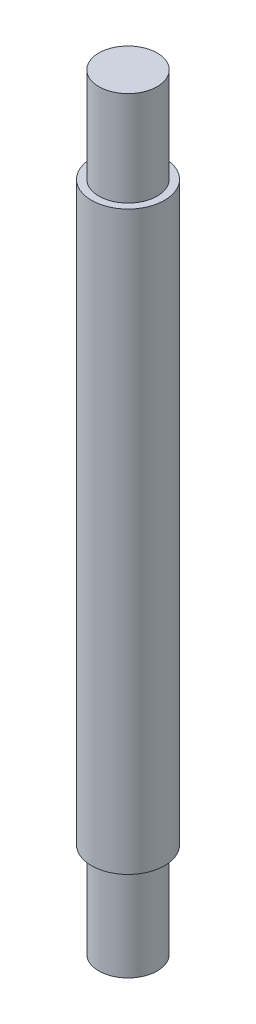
from build123d import *


with BuildPart() as part:
    # Sketch1 → Revolve1 (revolve)
    with BuildSketch(Plane.XY, mode=Mode.PRIVATE) as revolve1_sk:
        Polygon((0, 52.5), (4, 52.5), (4, 39.5), (5, 39.5), (5, -39.5), (4, -39.5), (4, -52.5), (0, -52.5), align=None)
    revolve(revolve1_sk.sketch.rotate(Axis((0, 0, 0), (0, 1, 0)), 90), axis=Axis((0, 0, 0), (0, 1, 0)))


solid = part.part
